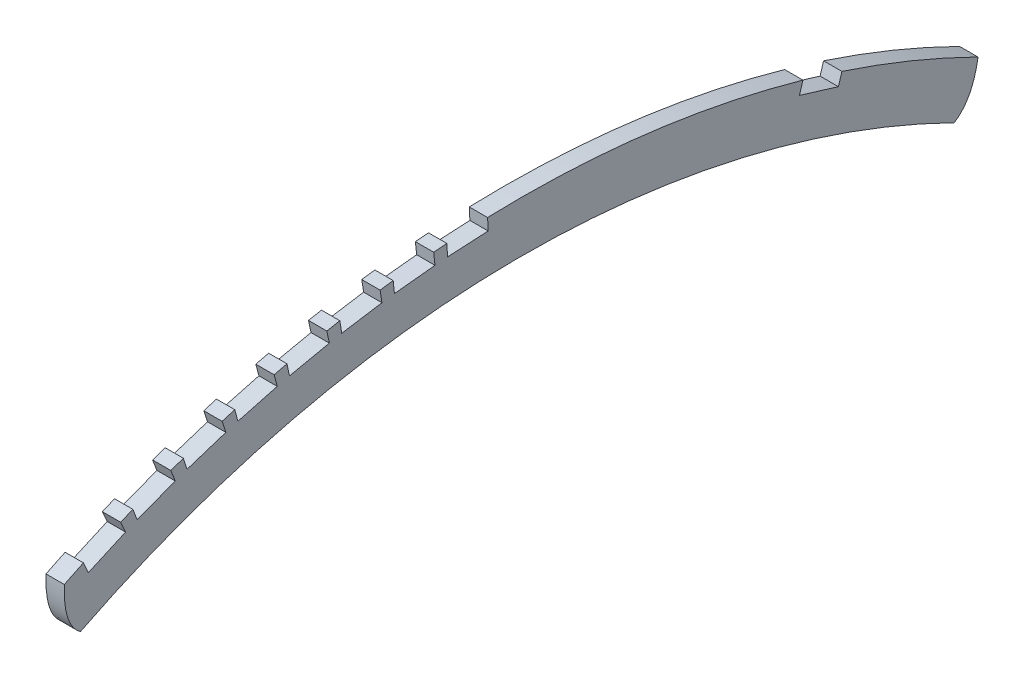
ISO-10303-21;
HEADER;
FILE_DESCRIPTION(('STEP AP214'),'2;1');
FILE_NAME('part.step','',(''),(''),'','','');
FILE_SCHEMA(('AUTOMOTIVE_DESIGN { 1 0 10303 214 1 1 1 1 }'));
ENDSEC;
DATA;
#1=APPLICATION_CONTEXT('core data for automotive mechanical design processes');
#2=APPLICATION_PROTOCOL_DEFINITION('international standard','automotive_design',2000,#1);
#3=PRODUCT_CONTEXT('',#1,'mechanical');
#4=PRODUCT('Part','Part','',(#3));
#5=PRODUCT_RELATED_PRODUCT_CATEGORY('part','',(#4));
#6=PRODUCT_DEFINITION_FORMATION('','',#4);
#7=PRODUCT_DEFINITION_CONTEXT('part definition',#1,'design');
#8=PRODUCT_DEFINITION('design','',#6,#7);
#9=PRODUCT_DEFINITION_SHAPE('','',#8);
#10=(LENGTH_UNIT() NAMED_UNIT(*) SI_UNIT(.MILLI.,.METRE.));
#11=(NAMED_UNIT(*) PLANE_ANGLE_UNIT() SI_UNIT($,.RADIAN.));
#12=(NAMED_UNIT(*) SI_UNIT($,.STERADIAN.) SOLID_ANGLE_UNIT());
#13=UNCERTAINTY_MEASURE_WITH_UNIT(LENGTH_MEASURE(1.E-05),#10,'distance_accuracy_value','');
#14=(GEOMETRIC_REPRESENTATION_CONTEXT(3) GLOBAL_UNCERTAINTY_ASSIGNED_CONTEXT((#13)) GLOBAL_UNIT_ASSIGNED_CONTEXT((#10,
#11,#12)) REPRESENTATION_CONTEXT('',''));
#15=CARTESIAN_POINT('',(0.,0.,0.));
#16=DIRECTION('',(0.,0.,1.));
#17=DIRECTION('',(1.,0.,0.));
#18=AXIS2_PLACEMENT_3D('',#15,#16,#17);
#19=CARTESIAN_POINT('',(18.,907.152568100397,448.573516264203));
#20=CARTESIAN_POINT('',(18.,883.276847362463,449.445951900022));
#21=CARTESIAN_POINT('',(18.,867.289284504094,444.157653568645));
#22=CARTESIAN_POINT('',(18.,859.189879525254,432.708621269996));
#23=B_SPLINE_CURVE_WITH_KNOTS('',3,(#19,#20,#21,#22),.UNSPECIFIED.,.F.,.F.,(4,4),(0.,
0.457409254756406),.UNSPECIFIED.);
#24=DIRECTION('',(-1.,0.,0.));
#25=VECTOR('',#24,1.);
#26=SURFACE_OF_LINEAR_EXTRUSION('',#23,#25);
#27=CARTESIAN_POINT('',(0.,907.152568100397,448.573516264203));
#28=CARTESIAN_POINT('',(0.,883.276847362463,449.445951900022));
#29=CARTESIAN_POINT('',(0.,867.289284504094,444.157653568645));
#30=CARTESIAN_POINT('',(0.,859.189879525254,432.708621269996));
#31=B_SPLINE_CURVE_WITH_KNOTS('',3,(#27,#28,#29,#30),.UNSPECIFIED.,.F.,.F.,(4,4),(0.,
0.457409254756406),.UNSPECIFIED.);
#32=CARTESIAN_POINT('',(0.,907.152568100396,448.573516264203));
#33=VERTEX_POINT('',#32);
#34=CARTESIAN_POINT('',(0.,859.189879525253,432.708621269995));
#35=VERTEX_POINT('',#34);
#36=EDGE_CURVE('E323',#33,#35,#31,.T.);
#37=ORIENTED_EDGE('',*,*,#36,.T.);
#38=DIRECTION('',(-1.,0.,0.));
#39=VECTOR('',#38,1.);
#40=CARTESIAN_POINT('',(18.,859.189879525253,432.708621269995));
#41=LINE('',#40,#39);
#42=CARTESIAN_POINT('',(18.,859.189879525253,432.708621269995));
#43=VERTEX_POINT('',#42);
#44=EDGE_CURVE('E12',#43,#35,#41,.T.);
#45=ORIENTED_EDGE('',*,*,#44,.F.);
#46=CARTESIAN_POINT('',(18.,907.152568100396,448.573516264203));
#47=VERTEX_POINT('',#46);
#48=EDGE_CURVE('E344',#47,#43,#23,.T.);
#49=ORIENTED_EDGE('',*,*,#48,.F.);
#50=DIRECTION('',(-1.,0.,0.));
#51=VECTOR('',#50,1.);
#52=CARTESIAN_POINT('',(18.,907.152568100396,448.573516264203));
#53=LINE('',#52,#51);
#54=EDGE_CURVE('E319',#47,#33,#53,.T.);
#55=ORIENTED_EDGE('',*,*,#54,.T.);
#56=EDGE_LOOP('',(#37,#45,#49,#55));
#57=FACE_BOUND('',#56,.T.);
#58=ADVANCED_FACE('F35',(#57),#26,.F.);
#59=CARTESIAN_POINT('',(18.,0.,0.));
#60=DIRECTION('',(-1.,0.,0.));
#61=DIRECTION('',(0.,0.,1.));
#62=AXIS2_PLACEMENT_3D('',#59,#60,#61);
#63=CYLINDRICAL_SURFACE('',#62,962.);
#64=CARTESIAN_POINT('',(0.,0.,0.));
#65=DIRECTION('',(-1.,0.,0.));
#66=DIRECTION('',(0.,0.,-1.));
#67=AXIS2_PLACEMENT_3D('',#64,#65,#66);
#68=CIRCLE('',#67,962.);
#69=CARTESIAN_POINT('',(0.,862.911633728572,-425.238183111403));
#70=VERTEX_POINT('',#69);
#71=EDGE_CURVE('E329',#35,#70,#68,.T.);
#72=ORIENTED_EDGE('',*,*,#71,.T.);
#73=DIRECTION('',(-1.,0.,0.));
#74=VECTOR('',#73,1.);
#75=CARTESIAN_POINT('',(18.,862.911633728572,-425.238183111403));
#76=LINE('',#75,#74);
#77=CARTESIAN_POINT('',(18.,862.911633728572,-425.238183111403));
#78=VERTEX_POINT('',#77);
#79=EDGE_CURVE('E44',#78,#70,#76,.T.);
#80=ORIENTED_EDGE('',*,*,#79,.F.);
#81=CARTESIAN_POINT('',(18.,0.,0.));
#82=DIRECTION('',(-1.,0.,0.));
#83=DIRECTION('',(0.,0.,-1.));
#84=AXIS2_PLACEMENT_3D('',#81,#82,#83);
#85=CIRCLE('',#84,962.);
#86=EDGE_CURVE('E191',#43,#78,#85,.T.);
#87=ORIENTED_EDGE('',*,*,#86,.F.);
#88=ORIENTED_EDGE('',*,*,#44,.T.);
#89=EDGE_LOOP('',(#72,#80,#87,#88));
#90=FACE_BOUND('',#89,.T.);
#91=ADVANCED_FACE('F758',(#90),#63,.F.);
#92=CARTESIAN_POINT('',(18.,862.911633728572,-425.238183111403));
#93=CARTESIAN_POINT('',(18.,870.69935136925,-437.404278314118));
#94=CARTESIAN_POINT('',(18.,885.44632947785,-445.18272272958));
#95=CARTESIAN_POINT('',(18.,907.152568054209,-448.573516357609));
#96=B_SPLINE_CURVE_WITH_KNOTS('',3,(#92,#93,#94,#95),.UNSPECIFIED.,.F.,.F.,(4,4),
(0.531870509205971,1.),.UNSPECIFIED.);
#97=DIRECTION('',(-1.,0.,0.));
#98=VECTOR('',#97,1.);
#99=SURFACE_OF_LINEAR_EXTRUSION('',#96,#98);
#100=CARTESIAN_POINT('',(0.,862.911633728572,-425.238183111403));
#101=CARTESIAN_POINT('',(0.,870.69935136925,-437.404278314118));
#102=CARTESIAN_POINT('',(0.,885.44632947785,-445.18272272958));
#103=CARTESIAN_POINT('',(0.,907.152568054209,-448.573516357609));
#104=B_SPLINE_CURVE_WITH_KNOTS('',3,(#100,#101,#102,#103),.UNSPECIFIED.,.F.,.F.,(4,4),
(0.531870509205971,1.),.UNSPECIFIED.);
#105=CARTESIAN_POINT('',(0.,907.152568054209,-448.573516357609));
#106=VERTEX_POINT('',#105);
#107=EDGE_CURVE('E457',#70,#106,#104,.T.);
#108=ORIENTED_EDGE('',*,*,#107,.T.);
#109=DIRECTION('',(-1.,0.,0.));
#110=VECTOR('',#109,1.);
#111=CARTESIAN_POINT('',(18.,907.152568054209,-448.573516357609));
#112=LINE('',#111,#110);
#113=CARTESIAN_POINT('',(18.,907.152568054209,-448.573516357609));
#114=VERTEX_POINT('',#113);
#115=EDGE_CURVE('E449',#114,#106,#112,.T.);
#116=ORIENTED_EDGE('',*,*,#115,.F.);
#117=EDGE_CURVE('E458',#78,#114,#96,.T.);
#118=ORIENTED_EDGE('',*,*,#117,.F.);
#119=ORIENTED_EDGE('',*,*,#79,.T.);
#120=EDGE_LOOP('',(#108,#116,#118,#119));
#121=FACE_BOUND('',#120,.T.);
#122=ADVANCED_FACE('F455',(#121),#99,.F.);
#123=CARTESIAN_POINT('',(18.,0.,0.));
#124=DIRECTION('',(-1.,0.,0.));
#125=DIRECTION('',(0.,0.,1.));
#126=AXIS2_PLACEMENT_3D('',#123,#124,#125);
#127=CYLINDRICAL_SURFACE('',#126,1011.99999076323);
#128=CARTESIAN_POINT('',(0.,0.,0.));
#129=DIRECTION('',(1.,0.,0.));
#130=DIRECTION('',(0.,0.,-1.));
#131=AXIS2_PLACEMENT_3D('',#128,#129,#130);
#132=CIRCLE('',#131,1011.99999076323);
#133=CARTESIAN_POINT('',(0.,961.743958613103,-314.948470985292));
#134=VERTEX_POINT('',#133);
#135=EDGE_CURVE('E464',#106,#134,#132,.T.);
#136=ORIENTED_EDGE('',*,*,#135,.T.);
#137=DIRECTION('',(-1.,0.,0.));
#138=VECTOR('',#137,1.);
#139=CARTESIAN_POINT('',(18.,961.743958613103,-314.948470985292));
#140=LINE('',#139,#138);
#141=CARTESIAN_POINT('',(18.,961.743958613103,-314.948470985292));
#142=VERTEX_POINT('',#141);
#143=EDGE_CURVE('E446',#142,#134,#140,.T.);
#144=ORIENTED_EDGE('',*,*,#143,.F.);
#145=CARTESIAN_POINT('',(18.,0.,0.));
#146=DIRECTION('',(1.,0.,0.));
#147=DIRECTION('',(0.,0.,-1.));
#148=AXIS2_PLACEMENT_3D('',#145,#146,#147);
#149=CIRCLE('',#148,1011.99999076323);
#150=EDGE_CURVE('E775',#114,#142,#149,.T.);
#151=ORIENTED_EDGE('',*,*,#150,.F.);
#152=ORIENTED_EDGE('',*,*,#115,.T.);
#153=EDGE_LOOP('',(#136,#144,#151,#152));
#154=FACE_BOUND('',#153,.T.);
#155=ADVANCED_FACE('F765',(#154),#127,.T.);
#156=CARTESIAN_POINT('',(18.,961.743958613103,-314.948470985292));
#157=DIRECTION('',(0.,-0.29237170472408,-0.956304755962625));
#158=DIRECTION('',(0.,0.956304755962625,-0.29237170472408));
#159=AXIS2_PLACEMENT_3D('',#156,#157,#158);
#160=PLANE('',#159);
#161=DIRECTION('',(0.,-0.956304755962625,0.29237170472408));
#162=VECTOR('',#161,1.);
#163=CARTESIAN_POINT('',(0.,961.743958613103,-314.948470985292));
#164=LINE('',#163,#162);
#165=CARTESIAN_POINT('',(0.,950.457321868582,-311.497799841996));
#166=VERTEX_POINT('',#165);
#167=EDGE_CURVE('E468',#134,#166,#164,.T.);
#168=ORIENTED_EDGE('',*,*,#167,.T.);
#169=DIRECTION('',(-1.,0.,0.));
#170=VECTOR('',#169,1.);
#171=CARTESIAN_POINT('',(18.,950.457321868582,-311.497799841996));
#172=LINE('',#171,#170);
#173=CARTESIAN_POINT('',(18.,950.457321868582,-311.497799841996));
#174=VERTEX_POINT('',#173);
#175=EDGE_CURVE('E443',#174,#166,#172,.T.);
#176=ORIENTED_EDGE('',*,*,#175,.F.);
#177=DIRECTION('',(0.,-0.956304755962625,0.29237170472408));
#178=VECTOR('',#177,1.);
#179=CARTESIAN_POINT('',(18.,961.743958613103,-314.948470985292));
#180=LINE('',#179,#178);
#181=EDGE_CURVE('E780',#142,#174,#180,.T.);
#182=ORIENTED_EDGE('',*,*,#181,.F.);
#183=ORIENTED_EDGE('',*,*,#143,.T.);
#184=EDGE_LOOP('',(#168,#176,#182,#183));
#185=FACE_BOUND('',#184,.T.);
#186=ADVANCED_FACE('F795',(#185),#160,.F.);
#187=CARTESIAN_POINT('',(18.,956.304755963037,-292.371704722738));
#188=DIRECTION('',(0.,-0.956304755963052,0.292371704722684));
#189=DIRECTION('',(0.,-0.292371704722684,-0.956304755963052));
#190=AXIS2_PLACEMENT_3D('',#187,#188,#189);
#191=PLANE('',#190);
#192=DIRECTION('',(0.,0.292371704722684,0.956304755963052));
#193=VECTOR('',#192,1.);
#194=CARTESIAN_POINT('',(0.,956.304755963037,-292.371704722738));
#195=LINE('',#194,#193);
#196=CARTESIAN_POINT('',(0.,962.152190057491,-273.245609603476));
#197=VERTEX_POINT('',#196);
#198=EDGE_CURVE('E486',#166,#197,#195,.T.);
#199=ORIENTED_EDGE('',*,*,#198,.T.);
#200=DIRECTION('',(-1.,0.,0.));
#201=VECTOR('',#200,1.);
#202=CARTESIAN_POINT('',(18.,962.152190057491,-273.245609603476));
#203=LINE('',#202,#201);
#204=CARTESIAN_POINT('',(18.,962.152190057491,-273.245609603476));
#205=VERTEX_POINT('',#204);
#206=EDGE_CURVE('E440',#205,#197,#203,.T.);
#207=ORIENTED_EDGE('',*,*,#206,.F.);
#208=DIRECTION('',(0.,0.29237170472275,0.956304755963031));
#209=VECTOR('',#208,1.);
#210=CARTESIAN_POINT('',(18.,950.457321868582,-311.497799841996));
#211=LINE('',#210,#209);
#212=EDGE_CURVE('E782',#174,#205,#211,.T.);
#213=ORIENTED_EDGE('',*,*,#212,.F.);
#214=ORIENTED_EDGE('',*,*,#175,.T.);
#215=EDGE_LOOP('',(#199,#207,#213,#214));
#216=FACE_BOUND('',#215,.T.);
#217=ADVANCED_FACE('F798',(#216),#191,.F.);
#218=CARTESIAN_POINT('',(18.,962.152190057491,-273.245609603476));
#219=DIRECTION('',(0.,0.292371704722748,0.956304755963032));
#220=DIRECTION('',(0.,-0.956304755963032,0.292371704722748));
#221=AXIS2_PLACEMENT_3D('',#218,#219,#220);
#222=PLANE('',#221);
#223=DIRECTION('',(0.,0.956304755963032,-0.292371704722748));
#224=VECTOR('',#223,1.);
#225=CARTESIAN_POINT('',(0.,962.152190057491,-273.245609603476));
#226=LINE('',#225,#224);
#227=CARTESIAN_POINT('',(0.,973.438826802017,-276.696280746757));
#228=VERTEX_POINT('',#227);
#229=EDGE_CURVE('E490',#197,#228,#226,.T.);
#230=ORIENTED_EDGE('',*,*,#229,.T.);
#231=DIRECTION('',(-1.,0.,0.));
#232=VECTOR('',#231,1.);
#233=CARTESIAN_POINT('',(18.,973.438826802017,-276.696280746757));
#234=LINE('',#233,#232);
#235=CARTESIAN_POINT('',(18.,973.438826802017,-276.696280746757));
#236=VERTEX_POINT('',#235);
#237=EDGE_CURVE('E437',#236,#228,#234,.T.);
#238=ORIENTED_EDGE('',*,*,#237,.F.);
#239=DIRECTION('',(0.,0.956304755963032,-0.292371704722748));
#240=VECTOR('',#239,1.);
#241=CARTESIAN_POINT('',(18.,962.152190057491,-273.245609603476));
#242=LINE('',#241,#240);
#243=EDGE_CURVE('E784',#205,#236,#242,.T.);
#244=ORIENTED_EDGE('',*,*,#243,.F.);
#245=ORIENTED_EDGE('',*,*,#206,.T.);
#246=EDGE_LOOP('',(#230,#238,#244,#245));
#247=FACE_BOUND('',#246,.T.);
#248=ADVANCED_FACE('F791',(#247),#222,.F.);
#249=CARTESIAN_POINT('',(18.,0.,0.));
#250=DIRECTION('',(-1.,0.,0.));
#251=DIRECTION('',(0.,0.,1.));
#252=AXIS2_PLACEMENT_3D('',#249,#250,#251);
#253=CYLINDRICAL_SURFACE('',#252,1011.99999076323);
#254=CARTESIAN_POINT('',(0.,0.,0.));
#255=DIRECTION('',(1.,0.,0.));
#256=DIRECTION('',(0.,0.,-1.));
#257=AXIS2_PLACEMENT_3D('',#254,#255,#256);
#258=CIRCLE('',#257,1011.99999076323);
#259=CARTESIAN_POINT('',(0.,1011.46242218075,32.9810524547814));
#260=VERTEX_POINT('',#259);
#261=EDGE_CURVE('E494',#228,#260,#258,.T.);
#262=ORIENTED_EDGE('',*,*,#261,.T.);
#263=DIRECTION('',(-1.,0.,0.));
#264=VECTOR('',#263,1.);
#265=CARTESIAN_POINT('',(18.,1011.46242218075,32.9810524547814));
#266=LINE('',#265,#264);
#267=CARTESIAN_POINT('',(18.,1011.46242218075,32.9810524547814));
#268=VERTEX_POINT('',#267);
#269=EDGE_CURVE('E434',#268,#260,#266,.T.);
#270=ORIENTED_EDGE('',*,*,#269,.F.);
#271=CARTESIAN_POINT('',(18.,0.,0.));
#272=DIRECTION('',(1.,0.,0.));
#273=DIRECTION('',(0.,0.,-1.));
#274=AXIS2_PLACEMENT_3D('',#271,#272,#273);
#275=CIRCLE('',#274,1011.99999076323);
#276=EDGE_CURVE('E786',#236,#268,#275,.T.);
#277=ORIENTED_EDGE('',*,*,#276,.F.);
#278=ORIENTED_EDGE('',*,*,#237,.T.);
#279=EDGE_LOOP('',(#262,#270,#277,#278));
#280=FACE_BOUND('',#279,.T.);
#281=ADVANCED_FACE('F657',(#280),#253,.T.);
#282=CARTESIAN_POINT('',(18.,1011.46242218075,32.9810524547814));
#283=DIRECTION('',(0.,0.0523359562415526,-0.998629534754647));
#284=DIRECTION('',(0.,0.998629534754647,0.0523359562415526));
#285=AXIS2_PLACEMENT_3D('',#282,#283,#284);
#286=PLANE('',#285);
#287=DIRECTION('',(0.,-0.998629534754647,-0.0523359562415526));
#288=VECTOR('',#287,1.);
#289=CARTESIAN_POINT('',(0.,1011.46242218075,32.9810524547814));
#290=LINE('',#289,#288);
#291=CARTESIAN_POINT('',(0.,999.676253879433,32.3633655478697));
#292=VERTEX_POINT('',#291);
#293=EDGE_CURVE('E502',#260,#292,#290,.T.);
#294=ORIENTED_EDGE('',*,*,#293,.T.);
#295=DIRECTION('',(-1.,0.,0.));
#296=VECTOR('',#295,1.);
#297=CARTESIAN_POINT('',(18.,999.676253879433,32.3633655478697));
#298=LINE('',#297,#296);
#299=CARTESIAN_POINT('',(18.,999.676253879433,32.3633655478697));
#300=VERTEX_POINT('',#299);
#301=EDGE_CURVE('E431',#300,#292,#298,.T.);
#302=ORIENTED_EDGE('',*,*,#301,.F.);
#303=DIRECTION('',(0.,-0.998629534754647,-0.0523359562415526));
#304=VECTOR('',#303,1.);
#305=CARTESIAN_POINT('',(18.,1011.46242218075,32.9810524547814));
#306=LINE('',#305,#304);
#307=EDGE_CURVE('E666',#268,#300,#306,.T.);
#308=ORIENTED_EDGE('',*,*,#307,.F.);
#309=ORIENTED_EDGE('',*,*,#269,.T.);
#310=EDGE_LOOP('',(#294,#302,#308,#309));
#311=FACE_BOUND('',#310,.T.);
#312=ADVANCED_FACE('F664',(#311),#286,.F.);
#313=CARTESIAN_POINT('',(18.,998.629534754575,52.3359562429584));
#314=DIRECTION('',(0.,-0.99862953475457,-0.0523359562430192));
#315=DIRECTION('',(0.,0.0523359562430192,-0.99862953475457));
#316=AXIS2_PLACEMENT_3D('',#313,#314,#315);
#317=PLANE('',#316);
#318=DIRECTION('',(0.,-0.0523359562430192,0.99862953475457));
#319=VECTOR('',#318,1.);
#320=CARTESIAN_POINT('',(0.,998.629534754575,52.3359562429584));
#321=LINE('',#320,#319);
#322=CARTESIAN_POINT('',(0.,997.582815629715,72.3085469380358));
#323=VERTEX_POINT('',#322);
#324=EDGE_CURVE('E506',#292,#323,#321,.T.);
#325=ORIENTED_EDGE('',*,*,#324,.T.);
#326=DIRECTION('',(-1.,0.,0.));
#327=VECTOR('',#326,1.);
#328=CARTESIAN_POINT('',(18.,997.582815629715,72.3085469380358));
#329=LINE('',#328,#327);
#330=CARTESIAN_POINT('',(18.,997.582815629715,72.3085469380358));
#331=VERTEX_POINT('',#330);
#332=EDGE_CURVE('E428',#331,#323,#329,.T.);
#333=ORIENTED_EDGE('',*,*,#332,.F.);
#334=DIRECTION('',(0.,-0.0523359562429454,0.998629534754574));
#335=VECTOR('',#334,1.);
#336=CARTESIAN_POINT('',(18.,999.676253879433,32.3633655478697));
#337=LINE('',#336,#335);
#338=EDGE_CURVE('E680',#300,#331,#337,.T.);
#339=ORIENTED_EDGE('',*,*,#338,.F.);
#340=ORIENTED_EDGE('',*,*,#301,.T.);
#341=EDGE_LOOP('',(#325,#333,#339,#340));
#342=FACE_BOUND('',#341,.T.);
#343=ADVANCED_FACE('F671',(#342),#317,.F.);
#344=CARTESIAN_POINT('',(18.,997.582815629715,72.3085469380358));
#345=DIRECTION('',(0.,-0.0523359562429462,0.998629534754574));
#346=DIRECTION('',(0.,-0.998629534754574,-0.0523359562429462));
#347=AXIS2_PLACEMENT_3D('',#344,#345,#346);
#348=PLANE('',#347);
#349=DIRECTION('',(0.,0.998629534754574,0.0523359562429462));
#350=VECTOR('',#349,1.);
#351=CARTESIAN_POINT('',(0.,997.582815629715,72.3085469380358));
#352=LINE('',#351,#350);
#353=CARTESIAN_POINT('',(0.,1009.36898393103,72.9262338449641));
#354=VERTEX_POINT('',#353);
#355=EDGE_CURVE('E510',#323,#354,#352,.T.);
#356=ORIENTED_EDGE('',*,*,#355,.T.);
#357=DIRECTION('',(-1.,0.,0.));
#358=VECTOR('',#357,1.);
#359=CARTESIAN_POINT('',(18.,1009.36898393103,72.9262338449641));
#360=LINE('',#359,#358);
#361=CARTESIAN_POINT('',(18.,1009.36898393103,72.9262338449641));
#362=VERTEX_POINT('',#361);
#363=EDGE_CURVE('E425',#362,#354,#360,.T.);
#364=ORIENTED_EDGE('',*,*,#363,.F.);
#365=DIRECTION('',(0.,0.998629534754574,0.0523359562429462));
#366=VECTOR('',#365,1.);
#367=CARTESIAN_POINT('',(18.,997.582815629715,72.3085469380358));
#368=LINE('',#367,#366);
#369=EDGE_CURVE('E677',#331,#362,#368,.T.);
#370=ORIENTED_EDGE('',*,*,#369,.F.);
#371=ORIENTED_EDGE('',*,*,#332,.T.);
#372=EDGE_LOOP('',(#356,#364,#370,#371));
#373=FACE_BOUND('',#372,.T.);
#374=ADVANCED_FACE('F675',(#373),#348,.F.);
#375=CARTESIAN_POINT('',(18.,0.,0.));
#376=DIRECTION('',(-1.,0.,0.));
#377=DIRECTION('',(0.,0.,1.));
#378=AXIS2_PLACEMENT_3D('',#375,#376,#377);
#379=CYLINDRICAL_SURFACE('',#378,1011.99999076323);
#380=CARTESIAN_POINT('',(0.,0.,0.));
#381=DIRECTION('',(1.,0.,0.));
#382=DIRECTION('',(0.,0.,-1.));
#383=AXIS2_PLACEMENT_3D('',#380,#381,#382);
#384=CIRCLE('',#383,1011.99999076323);
#385=CARTESIAN_POINT('',(0.,1008.35015316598,85.8717061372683));
#386=VERTEX_POINT('',#385);
#387=EDGE_CURVE('E514',#354,#386,#384,.T.);
#388=ORIENTED_EDGE('',*,*,#387,.T.);
#389=DIRECTION('',(-1.,0.,0.));
#390=VECTOR('',#389,1.);
#391=CARTESIAN_POINT('',(18.,1008.35015316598,85.8717061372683));
#392=LINE('',#391,#390);
#393=CARTESIAN_POINT('',(18.,1008.35015316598,85.8717061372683));
#394=VERTEX_POINT('',#393);
#395=EDGE_CURVE('E422',#394,#386,#392,.T.);
#396=ORIENTED_EDGE('',*,*,#395,.F.);
#397=CARTESIAN_POINT('',(18.,0.,0.));
#398=DIRECTION('',(1.,0.,0.));
#399=DIRECTION('',(0.,0.,-1.));
#400=AXIS2_PLACEMENT_3D('',#397,#398,#399);
#401=CIRCLE('',#400,1011.99999076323);
#402=EDGE_CURVE('E679',#362,#394,#401,.T.);
#403=ORIENTED_EDGE('',*,*,#402,.F.);
#404=ORIENTED_EDGE('',*,*,#363,.T.);
#405=EDGE_LOOP('',(#388,#396,#403,#404));
#406=FACE_BOUND('',#405,.T.);
#407=ADVANCED_FACE('F815',(#406),#379,.T.);
#408=CARTESIAN_POINT('',(18.,1008.35015316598,85.8717061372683));
#409=DIRECTION('',(0.,0.104528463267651,-0.994521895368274));
#410=DIRECTION('',(0.,0.994521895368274,0.104528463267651));
#411=AXIS2_PLACEMENT_3D('',#408,#409,#410);
#412=PLANE('',#411);
#413=DIRECTION('',(0.,-0.994521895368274,-0.104528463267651));
#414=VECTOR('',#413,1.);
#415=CARTESIAN_POINT('',(0.,1008.35015316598,85.8717061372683));
#416=LINE('',#415,#414);
#417=CARTESIAN_POINT('',(0.,996.612464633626,84.6380253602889));
#418=VERTEX_POINT('',#417);
#419=EDGE_CURVE('E522',#386,#418,#416,.T.);
#420=ORIENTED_EDGE('',*,*,#419,.T.);
#421=DIRECTION('',(-1.,0.,0.));
#422=VECTOR('',#421,1.);
#423=CARTESIAN_POINT('',(18.,996.612464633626,84.6380253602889));
#424=LINE('',#423,#422);
#425=CARTESIAN_POINT('',(18.,996.612464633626,84.6380253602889));
#426=VERTEX_POINT('',#425);
#427=EDGE_CURVE('E419',#426,#418,#424,.T.);
#428=ORIENTED_EDGE('',*,*,#427,.F.);
#429=DIRECTION('',(0.,-0.994521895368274,-0.104528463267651));
#430=VECTOR('',#429,1.);
#431=CARTESIAN_POINT('',(18.,1008.35015316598,85.8717061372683));
#432=LINE('',#431,#430);
#433=EDGE_CURVE('E682',#394,#426,#432,.T.);
#434=ORIENTED_EDGE('',*,*,#433,.F.);
#435=ORIENTED_EDGE('',*,*,#395,.T.);
#436=EDGE_LOOP('',(#420,#428,#434,#435));
#437=FACE_BOUND('',#436,.T.);
#438=ADVANCED_FACE('F818',(#437),#412,.F.);
#439=CARTESIAN_POINT('',(18.,994.521895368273,104.528463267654));
#440=DIRECTION('',(0.,-0.994521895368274,-0.104528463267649));
#441=DIRECTION('',(0.,0.104528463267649,-0.994521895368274));
#442=AXIS2_PLACEMENT_3D('',#439,#440,#441);
#443=PLANE('',#442);
#444=DIRECTION('',(0.,-0.104528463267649,0.994521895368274));
#445=VECTOR('',#444,1.);
#446=CARTESIAN_POINT('',(0.,994.521895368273,104.528463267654));
#447=LINE('',#446,#445);
#448=CARTESIAN_POINT('',(0.,992.43132610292,124.41890117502));
#449=VERTEX_POINT('',#448);
#450=EDGE_CURVE('E526',#418,#449,#447,.T.);
#451=ORIENTED_EDGE('',*,*,#450,.T.);
#452=DIRECTION('',(-1.,0.,0.));
#453=VECTOR('',#452,1.);
#454=CARTESIAN_POINT('',(18.,992.43132610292,124.41890117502));
#455=LINE('',#454,#453);
#456=CARTESIAN_POINT('',(18.,992.43132610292,124.41890117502));
#457=VERTEX_POINT('',#456);
#458=EDGE_CURVE('E416',#457,#449,#455,.T.);
#459=ORIENTED_EDGE('',*,*,#458,.F.);
#460=DIRECTION('',(0.,-0.104528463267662,0.994521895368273));
#461=VECTOR('',#460,1.);
#462=CARTESIAN_POINT('',(18.,996.612464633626,84.6380253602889));
#463=LINE('',#462,#461);
#464=EDGE_CURVE('E688',#426,#457,#463,.T.);
#465=ORIENTED_EDGE('',*,*,#464,.F.);
#466=ORIENTED_EDGE('',*,*,#427,.T.);
#467=EDGE_LOOP('',(#451,#459,#465,#466));
#468=FACE_BOUND('',#467,.T.);
#469=ADVANCED_FACE('F822',(#468),#443,.F.);
#470=CARTESIAN_POINT('',(18.,992.43132610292,124.41890117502));
#471=DIRECTION('',(0.,-0.104528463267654,0.994521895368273));
#472=DIRECTION('',(0.,-0.994521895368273,-0.104528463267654));
#473=AXIS2_PLACEMENT_3D('',#470,#471,#472);
#474=PLANE('',#473);
#475=DIRECTION('',(0.,0.994521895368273,0.104528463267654));
#476=VECTOR('',#475,1.);
#477=CARTESIAN_POINT('',(0.,992.43132610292,124.41890117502));
#478=LINE('',#477,#476);
#479=CARTESIAN_POINT('',(0.,1004.16901463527,125.652581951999));
#480=VERTEX_POINT('',#479);
#481=EDGE_CURVE('E530',#449,#480,#478,.T.);
#482=ORIENTED_EDGE('',*,*,#481,.T.);
#483=DIRECTION('',(-1.,0.,0.));
#484=VECTOR('',#483,1.);
#485=CARTESIAN_POINT('',(18.,1004.16901463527,125.652581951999));
#486=LINE('',#485,#484);
#487=CARTESIAN_POINT('',(18.,1004.16901463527,125.652581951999));
#488=VERTEX_POINT('',#487);
#489=EDGE_CURVE('E413',#488,#480,#486,.T.);
#490=ORIENTED_EDGE('',*,*,#489,.F.);
#491=DIRECTION('',(0.,0.994521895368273,0.104528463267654));
#492=VECTOR('',#491,1.);
#493=CARTESIAN_POINT('',(18.,992.43132610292,124.41890117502));
#494=LINE('',#493,#492);
#495=EDGE_CURVE('E690',#457,#488,#494,.T.);
#496=ORIENTED_EDGE('',*,*,#495,.F.);
#497=ORIENTED_EDGE('',*,*,#458,.T.);
#498=EDGE_LOOP('',(#482,#490,#496,#497));
#499=FACE_BOUND('',#498,.T.);
#500=ADVANCED_FACE('F826',(#499),#474,.F.);
#501=CARTESIAN_POINT('',(18.,0.,0.));
#502=DIRECTION('',(-1.,0.,0.));
#503=DIRECTION('',(0.,0.,1.));
#504=AXIS2_PLACEMENT_3D('',#501,#502,#503);
#505=CYLINDRICAL_SURFACE('',#504,1011.99999076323);
#506=CARTESIAN_POINT('',(0.,0.,0.));
#507=DIRECTION('',(1.,0.,0.));
#508=DIRECTION('',(0.,0.,-1.));
#509=AXIS2_PLACEMENT_3D('',#506,#507,#508);
#510=CIRCLE('',#509,1011.99999076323);
#511=CARTESIAN_POINT('',(0.,1002.47406647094,138.526991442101));
#512=VERTEX_POINT('',#511);
#513=EDGE_CURVE('E534',#480,#512,#510,.T.);
#514=ORIENTED_EDGE('',*,*,#513,.T.);
#515=DIRECTION('',(-1.,0.,0.));
#516=VECTOR('',#515,1.);
#517=CARTESIAN_POINT('',(18.,1002.47406647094,138.526991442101));
#518=LINE('',#517,#516);
#519=CARTESIAN_POINT('',(18.,1002.47406647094,138.526991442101));
#520=VERTEX_POINT('',#519);
#521=EDGE_CURVE('E410',#520,#512,#518,.T.);
#522=ORIENTED_EDGE('',*,*,#521,.F.);
#523=CARTESIAN_POINT('',(18.,0.,0.));
#524=DIRECTION('',(1.,0.,0.));
#525=DIRECTION('',(0.,0.,-1.));
#526=AXIS2_PLACEMENT_3D('',#523,#524,#525);
#527=CIRCLE('',#526,1011.99999076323);
#528=EDGE_CURVE('E692',#488,#520,#527,.T.);
#529=ORIENTED_EDGE('',*,*,#528,.F.);
#530=ORIENTED_EDGE('',*,*,#489,.T.);
#531=EDGE_LOOP('',(#514,#522,#529,#530));
#532=FACE_BOUND('',#531,.T.);
#533=ADVANCED_FACE('F830',(#532),#505,.T.);
#534=CARTESIAN_POINT('',(18.,1002.47406647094,138.526991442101));
#535=DIRECTION('',(0.,0.156434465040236,-0.987688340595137));
#536=DIRECTION('',(0.,0.987688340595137,0.156434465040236));
#537=AXIS2_PLACEMENT_3D('',#534,#535,#536);
#538=PLANE('',#537);
#539=DIRECTION('',(0.,-0.987688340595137,-0.156434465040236));
#540=VECTOR('',#539,1.);
#541=CARTESIAN_POINT('',(0.,1002.47406647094,138.526991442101));
#542=LINE('',#541,#540);
#543=CARTESIAN_POINT('',(0.,990.817029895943,136.680698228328));
#544=VERTEX_POINT('',#543);
#545=EDGE_CURVE('E542',#512,#544,#542,.T.);
#546=ORIENTED_EDGE('',*,*,#545,.T.);
#547=DIRECTION('',(-1.,0.,0.));
#548=VECTOR('',#547,1.);
#549=CARTESIAN_POINT('',(18.,990.817029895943,136.680698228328));
#550=LINE('',#549,#548);
#551=CARTESIAN_POINT('',(18.,990.817029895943,136.680698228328));
#552=VERTEX_POINT('',#551);
#553=EDGE_CURVE('E407',#552,#544,#550,.T.);
#554=ORIENTED_EDGE('',*,*,#553,.F.);
#555=DIRECTION('',(0.,-0.987688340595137,-0.156434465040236));
#556=VECTOR('',#555,1.);
#557=CARTESIAN_POINT('',(18.,1002.47406647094,138.526991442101));
#558=LINE('',#557,#556);
#559=EDGE_CURVE('E694',#520,#552,#558,.T.);
#560=ORIENTED_EDGE('',*,*,#559,.F.);
#561=ORIENTED_EDGE('',*,*,#521,.T.);
#562=EDGE_LOOP('',(#546,#554,#560,#561));
#563=FACE_BOUND('',#562,.T.);
#564=ADVANCED_FACE('F834',(#563),#538,.F.);
#565=CARTESIAN_POINT('',(18.,987.688340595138,156.434465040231));
#566=DIRECTION('',(0.,-0.987688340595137,-0.156434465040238));
#567=DIRECTION('',(0.,0.156434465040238,-0.987688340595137));
#568=AXIS2_PLACEMENT_3D('',#565,#566,#567);
#569=PLANE('',#568);
#570=DIRECTION('',(0.,-0.156434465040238,0.987688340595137));
#571=VECTOR('',#570,1.);
#572=CARTESIAN_POINT('',(0.,987.688340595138,156.434465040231));
#573=LINE('',#572,#571);
#574=CARTESIAN_POINT('',(0.,984.559651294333,176.188231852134));
#575=VERTEX_POINT('',#574);
#576=EDGE_CURVE('E546',#544,#575,#573,.T.);
#577=ORIENTED_EDGE('',*,*,#576,.T.);
#578=DIRECTION('',(-1.,0.,0.));
#579=VECTOR('',#578,1.);
#580=CARTESIAN_POINT('',(18.,984.559651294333,176.188231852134));
#581=LINE('',#580,#579);
#582=CARTESIAN_POINT('',(18.,984.559651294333,176.188231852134));
#583=VERTEX_POINT('',#582);
#584=EDGE_CURVE('E404',#583,#575,#581,.T.);
#585=ORIENTED_EDGE('',*,*,#584,.F.);
#586=DIRECTION('',(0.,-0.156434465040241,0.987688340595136));
#587=VECTOR('',#586,1.);
#588=CARTESIAN_POINT('',(18.,990.817029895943,136.680698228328));
#589=LINE('',#588,#587);
#590=EDGE_CURVE('E696',#552,#583,#589,.T.);
#591=ORIENTED_EDGE('',*,*,#590,.F.);
#592=ORIENTED_EDGE('',*,*,#553,.T.);
#593=EDGE_LOOP('',(#577,#585,#591,#592));
#594=FACE_BOUND('',#593,.T.);
#595=ADVANCED_FACE('F838',(#594),#569,.F.);
#596=CARTESIAN_POINT('',(18.,984.559651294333,176.188231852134));
#597=DIRECTION('',(0.,-0.156434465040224,0.987688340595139));
#598=DIRECTION('',(0.,-0.987688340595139,-0.156434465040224));
#599=AXIS2_PLACEMENT_3D('',#596,#597,#598);
#600=PLANE('',#599);
#601=DIRECTION('',(0.,0.987688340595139,0.156434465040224));
#602=VECTOR('',#601,1.);
#603=CARTESIAN_POINT('',(0.,984.559651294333,176.188231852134));
#604=LINE('',#603,#602);
#605=CARTESIAN_POINT('',(0.,996.216687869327,178.034525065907));
#606=VERTEX_POINT('',#605);
#607=EDGE_CURVE('E550',#575,#606,#604,.T.);
#608=ORIENTED_EDGE('',*,*,#607,.T.);
#609=DIRECTION('',(-1.,0.,0.));
#610=VECTOR('',#609,1.);
#611=CARTESIAN_POINT('',(18.,996.216687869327,178.034525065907));
#612=LINE('',#611,#610);
#613=CARTESIAN_POINT('',(18.,996.216687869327,178.034525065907));
#614=VERTEX_POINT('',#613);
#615=EDGE_CURVE('E401',#614,#606,#612,.T.);
#616=ORIENTED_EDGE('',*,*,#615,.F.);
#617=DIRECTION('',(0.,0.987688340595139,0.156434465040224));
#618=VECTOR('',#617,1.);
#619=CARTESIAN_POINT('',(18.,984.559651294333,176.188231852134));
#620=LINE('',#619,#618);
#621=EDGE_CURVE('E698',#583,#614,#620,.T.);
#622=ORIENTED_EDGE('',*,*,#621,.F.);
#623=ORIENTED_EDGE('',*,*,#584,.T.);
#624=EDGE_LOOP('',(#608,#616,#622,#623));
#625=FACE_BOUND('',#624,.T.);
#626=ADVANCED_FACE('F842',(#625),#600,.F.);
#627=CARTESIAN_POINT('',(18.,0.,0.));
#628=DIRECTION('',(-1.,0.,0.));
#629=DIRECTION('',(0.,0.,1.));
#630=AXIS2_PLACEMENT_3D('',#627,#628,#629);
#631=CYLINDRICAL_SURFACE('',#630,1011.99999076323);
#632=CARTESIAN_POINT('',(0.,0.,0.));
#633=DIRECTION('',(1.,0.,0.));
#634=DIRECTION('',(0.,0.,-1.));
#635=AXIS2_PLACEMENT_3D('',#632,#633,#634);
#636=CIRCLE('',#635,1011.99999076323);
#637=CARTESIAN_POINT('',(0.,993.850268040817,190.802583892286));
#638=VERTEX_POINT('',#637);
#639=EDGE_CURVE('E554',#606,#638,#636,.T.);
#640=ORIENTED_EDGE('',*,*,#639,.T.);
#641=DIRECTION('',(-1.,0.,0.));
#642=VECTOR('',#641,1.);
#643=CARTESIAN_POINT('',(18.,993.850268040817,190.802583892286));
#644=LINE('',#643,#642);
#645=CARTESIAN_POINT('',(18.,993.850268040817,190.802583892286));
#646=VERTEX_POINT('',#645);
#647=EDGE_CURVE('E398',#646,#638,#644,.T.);
#648=ORIENTED_EDGE('',*,*,#647,.F.);
#649=CARTESIAN_POINT('',(18.,0.,0.));
#650=DIRECTION('',(1.,0.,0.));
#651=DIRECTION('',(0.,0.,-1.));
#652=AXIS2_PLACEMENT_3D('',#649,#650,#651);
#653=CIRCLE('',#652,1011.99999076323);
#654=EDGE_CURVE('E700',#614,#646,#653,.T.);
#655=ORIENTED_EDGE('',*,*,#654,.F.);
#656=ORIENTED_EDGE('',*,*,#615,.T.);
#657=EDGE_LOOP('',(#640,#648,#655,#656));
#658=FACE_BOUND('',#657,.T.);
#659=ADVANCED_FACE('F846',(#658),#631,.T.);
#660=CARTESIAN_POINT('',(18.,993.850268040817,190.802583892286));
#661=DIRECTION('',(0.,0.207911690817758,-0.978147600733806));
#662=DIRECTION('',(0.,0.978147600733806,0.207911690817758));
#663=AXIS2_PLACEMENT_3D('',#660,#661,#662);
#664=PLANE('',#663);
#665=DIRECTION('',(0.,-0.978147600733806,-0.207911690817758));
#666=VECTOR('',#665,1.);
#667=CARTESIAN_POINT('',(0.,993.850268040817,190.802583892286));
#668=LINE('',#667,#666);
#669=CARTESIAN_POINT('',(0.,982.305834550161,188.348738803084));
#670=VERTEX_POINT('',#669);
#671=EDGE_CURVE('E562',#638,#670,#668,.T.);
#672=ORIENTED_EDGE('',*,*,#671,.T.);
#673=DIRECTION('',(-1.,0.,0.));
#674=VECTOR('',#673,1.);
#675=CARTESIAN_POINT('',(18.,982.305834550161,188.348738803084));
#676=LINE('',#675,#674);
#677=CARTESIAN_POINT('',(18.,982.305834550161,188.348738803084));
#678=VERTEX_POINT('',#677);
#679=EDGE_CURVE('E395',#678,#670,#676,.T.);
#680=ORIENTED_EDGE('',*,*,#679,.F.);
#681=DIRECTION('',(0.,-0.978147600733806,-0.207911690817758));
#682=VECTOR('',#681,1.);
#683=CARTESIAN_POINT('',(18.,993.850268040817,190.802583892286));
#684=LINE('',#683,#682);
#685=EDGE_CURVE('E702',#646,#678,#684,.T.);
#686=ORIENTED_EDGE('',*,*,#685,.F.);
#687=ORIENTED_EDGE('',*,*,#647,.T.);
#688=EDGE_LOOP('',(#672,#680,#686,#687));
#689=FACE_BOUND('',#688,.T.);
#690=ADVANCED_FACE('F850',(#689),#664,.F.);
#691=CARTESIAN_POINT('',(18.,978.147600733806,207.91169081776));
#692=DIRECTION('',(0.,-0.978147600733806,-0.207911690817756));
#693=DIRECTION('',(0.,0.207911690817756,-0.978147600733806));
#694=AXIS2_PLACEMENT_3D('',#691,#692,#693);
#695=PLANE('',#694);
#696=DIRECTION('',(0.,-0.207911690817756,0.978147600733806));
#697=VECTOR('',#696,1.);
#698=CARTESIAN_POINT('',(0.,978.147600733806,207.91169081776));
#699=LINE('',#698,#697);
#700=CARTESIAN_POINT('',(0.,973.98936691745,227.474642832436));
#701=VERTEX_POINT('',#700);
#702=EDGE_CURVE('E566',#670,#701,#699,.T.);
#703=ORIENTED_EDGE('',*,*,#702,.T.);
#704=DIRECTION('',(-1.,0.,0.));
#705=VECTOR('',#704,1.);
#706=CARTESIAN_POINT('',(18.,973.98936691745,227.474642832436));
#707=LINE('',#706,#705);
#708=CARTESIAN_POINT('',(18.,973.98936691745,227.474642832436));
#709=VERTEX_POINT('',#708);
#710=EDGE_CURVE('E392',#709,#701,#707,.T.);
#711=ORIENTED_EDGE('',*,*,#710,.F.);
#712=DIRECTION('',(0.,-0.207911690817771,0.978147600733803));
#713=VECTOR('',#712,1.);
#714=CARTESIAN_POINT('',(18.,982.305834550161,188.348738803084));
#715=LINE('',#714,#713);
#716=EDGE_CURVE('E704',#678,#709,#715,.T.);
#717=ORIENTED_EDGE('',*,*,#716,.F.);
#718=ORIENTED_EDGE('',*,*,#679,.T.);
#719=EDGE_LOOP('',(#703,#711,#717,#718));
#720=FACE_BOUND('',#719,.T.);
#721=ADVANCED_FACE('F854',(#720),#695,.F.);
#722=CARTESIAN_POINT('',(18.,973.98936691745,227.474642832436));
#723=DIRECTION('',(0.,-0.207911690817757,0.978147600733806));
#724=DIRECTION('',(0.,-0.978147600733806,-0.207911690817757));
#725=AXIS2_PLACEMENT_3D('',#722,#723,#724);
#726=PLANE('',#725);
#727=DIRECTION('',(0.,0.978147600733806,0.207911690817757));
#728=VECTOR('',#727,1.);
#729=CARTESIAN_POINT('',(0.,973.98936691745,227.474642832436));
#730=LINE('',#729,#728);
#731=CARTESIAN_POINT('',(0.,985.533800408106,229.928487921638));
#732=VERTEX_POINT('',#731);
#733=EDGE_CURVE('E570',#701,#732,#730,.T.);
#734=ORIENTED_EDGE('',*,*,#733,.T.);
#735=DIRECTION('',(-1.,0.,0.));
#736=VECTOR('',#735,1.);
#737=CARTESIAN_POINT('',(18.,985.533800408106,229.928487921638));
#738=LINE('',#737,#736);
#739=CARTESIAN_POINT('',(18.,985.533800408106,229.928487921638));
#740=VERTEX_POINT('',#739);
#741=EDGE_CURVE('E389',#740,#732,#738,.T.);
#742=ORIENTED_EDGE('',*,*,#741,.F.);
#743=DIRECTION('',(0.,0.978147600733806,0.207911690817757));
#744=VECTOR('',#743,1.);
#745=CARTESIAN_POINT('',(18.,973.98936691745,227.474642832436));
#746=LINE('',#745,#744);
#747=EDGE_CURVE('E706',#709,#740,#746,.T.);
#748=ORIENTED_EDGE('',*,*,#747,.F.);
#749=ORIENTED_EDGE('',*,*,#710,.T.);
#750=EDGE_LOOP('',(#734,#742,#748,#749));
#751=FACE_BOUND('',#750,.T.);
#752=ADVANCED_FACE('F858',(#751),#726,.F.);
#753=CARTESIAN_POINT('',(18.,0.,0.));
#754=DIRECTION('',(-1.,0.,0.));
#755=DIRECTION('',(0.,0.,1.));
#756=AXIS2_PLACEMENT_3D('',#753,#754,#755);
#757=CYLINDRICAL_SURFACE('',#756,1011.99999076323);
#758=CARTESIAN_POINT('',(0.,0.,0.));
#759=DIRECTION('',(1.,0.,0.));
#760=DIRECTION('',(0.,0.,-1.));
#761=AXIS2_PLACEMENT_3D('',#758,#759,#760);
#762=CIRCLE('',#761,1011.99999076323);
#763=CARTESIAN_POINT('',(0.,982.502395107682,242.555199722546));
#764=VERTEX_POINT('',#763);
#765=EDGE_CURVE('E574',#732,#764,#762,.T.);
#766=ORIENTED_EDGE('',*,*,#765,.T.);
#767=DIRECTION('',(-1.,0.,0.));
#768=VECTOR('',#767,1.);
#769=CARTESIAN_POINT('',(18.,982.502395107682,242.555199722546));
#770=LINE('',#769,#768);
#771=CARTESIAN_POINT('',(18.,982.502395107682,242.555199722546));
#772=VERTEX_POINT('',#771);
#773=EDGE_CURVE('E386',#772,#764,#770,.T.);
#774=ORIENTED_EDGE('',*,*,#773,.F.);
#775=CARTESIAN_POINT('',(18.,0.,0.));
#776=DIRECTION('',(1.,0.,0.));
#777=DIRECTION('',(0.,0.,-1.));
#778=AXIS2_PLACEMENT_3D('',#775,#776,#777);
#779=CIRCLE('',#778,1011.99999076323);
#780=EDGE_CURVE('E708',#740,#772,#779,.T.);
#781=ORIENTED_EDGE('',*,*,#780,.F.);
#782=ORIENTED_EDGE('',*,*,#741,.T.);
#783=EDGE_LOOP('',(#766,#774,#781,#782));
#784=FACE_BOUND('',#783,.T.);
#785=ADVANCED_FACE('F862',(#784),#757,.T.);
#786=CARTESIAN_POINT('',(18.,982.502395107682,242.555199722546));
#787=DIRECTION('',(0.,0.258819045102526,-0.965925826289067));
#788=DIRECTION('',(0.,0.965925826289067,0.258819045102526));
#789=AXIS2_PLACEMENT_3D('',#786,#787,#788);
#790=PLANE('',#789);
#791=DIRECTION('',(0.,-0.965925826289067,-0.258819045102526));
#792=VECTOR('',#791,1.);
#793=CARTESIAN_POINT('',(0.,982.502395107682,242.555199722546));
#794=LINE('',#793,#792);
#795=CARTESIAN_POINT('',(0.,971.102207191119,239.50052857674));
#796=VERTEX_POINT('',#795);
#797=EDGE_CURVE('E582',#764,#796,#794,.T.);
#798=ORIENTED_EDGE('',*,*,#797,.T.);
#799=DIRECTION('',(-1.,0.,0.));
#800=VECTOR('',#799,1.);
#801=CARTESIAN_POINT('',(18.,971.102207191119,239.50052857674));
#802=LINE('',#801,#800);
#803=CARTESIAN_POINT('',(18.,971.102207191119,239.50052857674));
#804=VERTEX_POINT('',#803);
#805=EDGE_CURVE('E383',#804,#796,#802,.T.);
#806=ORIENTED_EDGE('',*,*,#805,.F.);
#807=DIRECTION('',(0.,-0.965925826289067,-0.258819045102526));
#808=VECTOR('',#807,1.);
#809=CARTESIAN_POINT('',(18.,982.502395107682,242.555199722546));
#810=LINE('',#809,#808);
#811=EDGE_CURVE('E710',#772,#804,#810,.T.);
#812=ORIENTED_EDGE('',*,*,#811,.F.);
#813=ORIENTED_EDGE('',*,*,#773,.T.);
#814=EDGE_LOOP('',(#798,#806,#812,#813));
#815=FACE_BOUND('',#814,.T.);
#816=ADVANCED_FACE('F866',(#815),#790,.F.);
#817=CARTESIAN_POINT('',(18.,965.925826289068,258.819045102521));
#818=DIRECTION('',(0.,-0.965925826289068,-0.258819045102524));
#819=DIRECTION('',(0.,0.258819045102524,-0.965925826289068));
#820=AXIS2_PLACEMENT_3D('',#817,#818,#819);
#821=PLANE('',#820);
#822=DIRECTION('',(0.,-0.258819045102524,0.965925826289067));
#823=VECTOR('',#822,1.);
#824=CARTESIAN_POINT('',(0.,965.925826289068,258.819045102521));
#825=LINE('',#824,#823);
#826=CARTESIAN_POINT('',(0.,960.749445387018,278.137561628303));
#827=VERTEX_POINT('',#826);
#828=EDGE_CURVE('E586',#796,#827,#825,.T.);
#829=ORIENTED_EDGE('',*,*,#828,.T.);
#830=DIRECTION('',(-1.,0.,0.));
#831=VECTOR('',#830,1.);
#832=CARTESIAN_POINT('',(18.,960.749445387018,278.137561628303));
#833=LINE('',#832,#831);
#834=CARTESIAN_POINT('',(18.,960.749445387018,278.137561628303));
#835=VERTEX_POINT('',#834);
#836=EDGE_CURVE('E380',#835,#827,#833,.T.);
#837=ORIENTED_EDGE('',*,*,#836,.F.);
#838=DIRECTION('',(0.,-0.258819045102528,0.965925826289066));
#839=VECTOR('',#838,1.);
#840=CARTESIAN_POINT('',(18.,971.102207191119,239.50052857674));
#841=LINE('',#840,#839);
#842=EDGE_CURVE('E712',#804,#835,#841,.T.);
#843=ORIENTED_EDGE('',*,*,#842,.F.);
#844=ORIENTED_EDGE('',*,*,#805,.T.);
#845=EDGE_LOOP('',(#829,#837,#843,#844));
#846=FACE_BOUND('',#845,.T.);
#847=ADVANCED_FACE('F870',(#846),#821,.F.);
#848=CARTESIAN_POINT('',(18.,960.749445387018,278.137561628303));
#849=DIRECTION('',(0.,-0.258819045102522,0.965925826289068));
#850=DIRECTION('',(0.,-0.965925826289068,-0.258819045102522));
#851=AXIS2_PLACEMENT_3D('',#848,#849,#850);
#852=PLANE('',#851);
#853=DIRECTION('',(0.,0.965925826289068,0.258819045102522));
#854=VECTOR('',#853,1.);
#855=CARTESIAN_POINT('',(0.,960.749445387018,278.137561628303));
#856=LINE('',#855,#854);
#857=CARTESIAN_POINT('',(0.,972.149633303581,281.192232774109));
#858=VERTEX_POINT('',#857);
#859=EDGE_CURVE('E590',#827,#858,#856,.T.);
#860=ORIENTED_EDGE('',*,*,#859,.T.);
#861=DIRECTION('',(-1.,0.,0.));
#862=VECTOR('',#861,1.);
#863=CARTESIAN_POINT('',(18.,972.149633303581,281.192232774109));
#864=LINE('',#863,#862);
#865=CARTESIAN_POINT('',(18.,972.149633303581,281.192232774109));
#866=VERTEX_POINT('',#865);
#867=EDGE_CURVE('E377',#866,#858,#864,.T.);
#868=ORIENTED_EDGE('',*,*,#867,.F.);
#869=DIRECTION('',(0.,0.965925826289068,0.258819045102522));
#870=VECTOR('',#869,1.);
#871=CARTESIAN_POINT('',(18.,960.749445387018,278.137561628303));
#872=LINE('',#871,#870);
#873=EDGE_CURVE('E714',#835,#866,#872,.T.);
#874=ORIENTED_EDGE('',*,*,#873,.F.);
#875=ORIENTED_EDGE('',*,*,#836,.T.);
#876=EDGE_LOOP('',(#860,#868,#874,#875));
#877=FACE_BOUND('',#876,.T.);
#878=ADVANCED_FACE('F874',(#877),#852,.F.);
#879=CARTESIAN_POINT('',(18.,0.,0.));
#880=DIRECTION('',(-1.,0.,0.));
#881=DIRECTION('',(0.,0.,1.));
#882=AXIS2_PLACEMENT_3D('',#879,#880,#881);
#883=CYLINDRICAL_SURFACE('',#882,1011.99999076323);
#884=CARTESIAN_POINT('',(0.,0.,0.));
#885=DIRECTION('',(1.,0.,0.));
#886=DIRECTION('',(0.,0.,-1.));
#887=AXIS2_PLACEMENT_3D('',#884,#885,#886);
#888=CIRCLE('',#887,1011.99999076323);
#889=CARTESIAN_POINT('',(0.,968.461551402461,293.642988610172));
#890=VERTEX_POINT('',#889);
#891=EDGE_CURVE('E594',#858,#890,#888,.T.);
#892=ORIENTED_EDGE('',*,*,#891,.T.);
#893=DIRECTION('',(-1.,0.,0.));
#894=VECTOR('',#893,1.);
#895=CARTESIAN_POINT('',(18.,968.461551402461,293.642988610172));
#896=LINE('',#895,#894);
#897=CARTESIAN_POINT('',(18.,968.461551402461,293.642988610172));
#898=VERTEX_POINT('',#897);
#899=EDGE_CURVE('E374',#898,#890,#896,.T.);
#900=ORIENTED_EDGE('',*,*,#899,.F.);
#901=CARTESIAN_POINT('',(18.,0.,0.));
#902=DIRECTION('',(1.,0.,0.));
#903=DIRECTION('',(0.,0.,-1.));
#904=AXIS2_PLACEMENT_3D('',#901,#902,#903);
#905=CIRCLE('',#904,1011.99999076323);
#906=EDGE_CURVE('E716',#866,#898,#905,.T.);
#907=ORIENTED_EDGE('',*,*,#906,.F.);
#908=ORIENTED_EDGE('',*,*,#867,.T.);
#909=EDGE_LOOP('',(#892,#900,#907,#908));
#910=FACE_BOUND('',#909,.T.);
#911=ADVANCED_FACE('F878',(#910),#883,.T.);
#912=CARTESIAN_POINT('',(18.,968.461551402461,293.642988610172));
#913=DIRECTION('',(0.,0.309016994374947,-0.951056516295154));
#914=DIRECTION('',(0.,0.951056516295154,0.309016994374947));
#915=AXIS2_PLACEMENT_3D('',#912,#913,#914);
#916=PLANE('',#915);
#917=DIRECTION('',(0.,-0.951056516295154,-0.309016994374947));
#918=VECTOR('',#917,1.);
#919=CARTESIAN_POINT('',(0.,968.461551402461,293.642988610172));
#920=LINE('',#919,#918);
#921=CARTESIAN_POINT('',(0.,957.236856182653,289.995864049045));
#922=VERTEX_POINT('',#921);
#923=EDGE_CURVE('E602',#890,#922,#920,.T.);
#924=ORIENTED_EDGE('',*,*,#923,.T.);
#925=DIRECTION('',(-1.,0.,0.));
#926=VECTOR('',#925,1.);
#927=CARTESIAN_POINT('',(18.,957.236856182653,289.995864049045));
#928=LINE('',#927,#926);
#929=CARTESIAN_POINT('',(18.,957.236856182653,289.995864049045));
#930=VERTEX_POINT('',#929);
#931=EDGE_CURVE('E371',#930,#922,#928,.T.);
#932=ORIENTED_EDGE('',*,*,#931,.F.);
#933=DIRECTION('',(0.,-0.951056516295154,-0.309016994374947));
#934=VECTOR('',#933,1.);
#935=CARTESIAN_POINT('',(18.,968.461551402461,293.642988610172));
#936=LINE('',#935,#934);
#937=EDGE_CURVE('E718',#898,#930,#936,.T.);
#938=ORIENTED_EDGE('',*,*,#937,.F.);
#939=ORIENTED_EDGE('',*,*,#899,.T.);
#940=EDGE_LOOP('',(#924,#932,#938,#939));
#941=FACE_BOUND('',#940,.T.);
#942=ADVANCED_FACE('F882',(#941),#916,.F.);
#943=CARTESIAN_POINT('',(18.,951.056516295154,309.016994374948));
#944=DIRECTION('',(0.,-0.951056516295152,-0.309016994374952));
#945=DIRECTION('',(0.,0.309016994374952,-0.951056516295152));
#946=AXIS2_PLACEMENT_3D('',#943,#944,#945);
#947=PLANE('',#946);
#948=DIRECTION('',(0.,-0.309016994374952,0.951056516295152));
#949=VECTOR('',#948,1.);
#950=CARTESIAN_POINT('',(0.,951.056516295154,309.016994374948));
#951=LINE('',#950,#949);
#952=CARTESIAN_POINT('',(0.,944.876176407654,328.038124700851));
#953=VERTEX_POINT('',#952);
#954=EDGE_CURVE('E606',#922,#953,#951,.T.);
#955=ORIENTED_EDGE('',*,*,#954,.T.);
#956=DIRECTION('',(-1.,0.,0.));
#957=VECTOR('',#956,1.);
#958=CARTESIAN_POINT('',(18.,944.876176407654,328.038124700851));
#959=LINE('',#958,#957);
#960=CARTESIAN_POINT('',(18.,944.876176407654,328.038124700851));
#961=VERTEX_POINT('',#960);
#962=EDGE_CURVE('E368',#961,#953,#959,.T.);
#963=ORIENTED_EDGE('',*,*,#962,.F.);
#964=DIRECTION('',(0.,-0.309016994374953,0.951056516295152));
#965=VECTOR('',#964,1.);
#966=CARTESIAN_POINT('',(18.,957.236856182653,289.995864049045));
#967=LINE('',#966,#965);
#968=EDGE_CURVE('E720',#930,#961,#967,.T.);
#969=ORIENTED_EDGE('',*,*,#968,.F.);
#970=ORIENTED_EDGE('',*,*,#931,.T.);
#971=EDGE_LOOP('',(#955,#963,#969,#970));
#972=FACE_BOUND('',#971,.T.);
#973=ADVANCED_FACE('F886',(#972),#947,.F.);
#974=CARTESIAN_POINT('',(18.,944.876176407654,328.038124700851));
#975=DIRECTION('',(0.,-0.309016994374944,0.951056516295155));
#976=DIRECTION('',(0.,-0.951056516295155,-0.309016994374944));
#977=AXIS2_PLACEMENT_3D('',#974,#975,#976);
#978=PLANE('',#977);
#979=DIRECTION('',(0.,0.951056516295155,0.309016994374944));
#980=VECTOR('',#979,1.);
#981=CARTESIAN_POINT('',(0.,944.876176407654,328.038124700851));
#982=LINE('',#981,#980);
#983=CARTESIAN_POINT('',(0.,956.100871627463,331.685249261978));
#984=VERTEX_POINT('',#983);
#985=EDGE_CURVE('E610',#953,#984,#982,.T.);
#986=ORIENTED_EDGE('',*,*,#985,.T.);
#987=DIRECTION('',(-1.,0.,0.));
#988=VECTOR('',#987,1.);
#989=CARTESIAN_POINT('',(18.,956.100871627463,331.685249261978));
#990=LINE('',#989,#988);
#991=CARTESIAN_POINT('',(18.,956.100871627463,331.685249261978));
#992=VERTEX_POINT('',#991);
#993=EDGE_CURVE('E365',#992,#984,#990,.T.);
#994=ORIENTED_EDGE('',*,*,#993,.F.);
#995=DIRECTION('',(0.,0.951056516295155,0.309016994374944));
#996=VECTOR('',#995,1.);
#997=CARTESIAN_POINT('',(18.,944.876176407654,328.038124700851));
#998=LINE('',#997,#996);
#999=EDGE_CURVE('E722',#961,#992,#998,.T.);
#1000=ORIENTED_EDGE('',*,*,#999,.F.);
#1001=ORIENTED_EDGE('',*,*,#962,.T.);
#1002=EDGE_LOOP('',(#986,#994,#1000,#1001));
#1003=FACE_BOUND('',#1002,.T.);
#1004=ADVANCED_FACE('F890',(#1003),#978,.F.);
#1005=CARTESIAN_POINT('',(18.,0.,0.));
#1006=DIRECTION('',(-1.,0.,0.));
#1007=DIRECTION('',(0.,0.,1.));
#1008=AXIS2_PLACEMENT_3D('',#1005,#1006,#1007);
#1009=CYLINDRICAL_SURFACE('',#1008,1011.99999076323);
#1010=CARTESIAN_POINT('',(0.,0.,0.));
#1011=DIRECTION('',(1.,0.,0.));
#1012=DIRECTION('',(0.,0.,-1.));
#1013=AXIS2_PLACEMENT_3D('',#1010,#1011,#1012);
#1014=CIRCLE('',#1013,1011.99999076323);
#1015=CARTESIAN_POINT('',(0.,951.766221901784,343.925922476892));
#1016=VERTEX_POINT('',#1015);
#1017=EDGE_CURVE('E614',#984,#1016,#1014,.T.);
#1018=ORIENTED_EDGE('',*,*,#1017,.T.);
#1019=DIRECTION('',(-1.,0.,0.));
#1020=VECTOR('',#1019,1.);
#1021=CARTESIAN_POINT('',(18.,951.766221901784,343.925922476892));
#1022=LINE('',#1021,#1020);
#1023=CARTESIAN_POINT('',(18.,951.766221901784,343.925922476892));
#1024=VERTEX_POINT('',#1023);
#1025=EDGE_CURVE('E362',#1024,#1016,#1022,.T.);
#1026=ORIENTED_EDGE('',*,*,#1025,.F.);
#1027=CARTESIAN_POINT('',(18.,0.,0.));
#1028=DIRECTION('',(1.,0.,0.));
#1029=DIRECTION('',(0.,0.,-1.));
#1030=AXIS2_PLACEMENT_3D('',#1027,#1028,#1029);
#1031=CIRCLE('',#1030,1011.99999076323);
#1032=EDGE_CURVE('E724',#992,#1024,#1031,.T.);
#1033=ORIENTED_EDGE('',*,*,#1032,.F.);
#1034=ORIENTED_EDGE('',*,*,#993,.T.);
#1035=EDGE_LOOP('',(#1018,#1026,#1033,#1034));
#1036=FACE_BOUND('',#1035,.T.);
#1037=ADVANCED_FACE('F894',(#1036),#1009,.T.);
#1038=CARTESIAN_POINT('',(18.,951.766221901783,343.925922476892));
#1039=DIRECTION('',(0.,0.358367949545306,-0.9335804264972));
#1040=DIRECTION('',(0.,0.9335804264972,0.358367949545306));
#1041=AXIS2_PLACEMENT_3D('',#1038,#1039,#1040);
#1042=PLANE('',#1041);
#1043=DIRECTION('',(0.,-0.9335804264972,-0.358367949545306));
#1044=VECTOR('',#1043,1.);
#1045=CARTESIAN_POINT('',(0.,951.766221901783,343.925922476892));
#1046=LINE('',#1045,#1044);
#1047=CARTESIAN_POINT('',(0.,940.747785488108,339.696341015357));
#1048=VERTEX_POINT('',#1047);
#1049=EDGE_CURVE('E622',#1016,#1048,#1046,.T.);
#1050=ORIENTED_EDGE('',*,*,#1049,.T.);
#1051=DIRECTION('',(-1.,0.,0.));
#1052=VECTOR('',#1051,1.);
#1053=CARTESIAN_POINT('',(18.,940.747785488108,339.696341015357));
#1054=LINE('',#1053,#1052);
#1055=CARTESIAN_POINT('',(18.,940.747785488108,339.696341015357));
#1056=VERTEX_POINT('',#1055);
#1057=EDGE_CURVE('E359',#1056,#1048,#1054,.T.);
#1058=ORIENTED_EDGE('',*,*,#1057,.F.);
#1059=DIRECTION('',(0.,-0.9335804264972,-0.358367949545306));
#1060=VECTOR('',#1059,1.);
#1061=CARTESIAN_POINT('',(18.,951.766221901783,343.925922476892));
#1062=LINE('',#1061,#1060);
#1063=EDGE_CURVE('E726',#1024,#1056,#1062,.T.);
#1064=ORIENTED_EDGE('',*,*,#1063,.F.);
#1065=ORIENTED_EDGE('',*,*,#1025,.T.);
#1066=EDGE_LOOP('',(#1050,#1058,#1064,#1065));
#1067=FACE_BOUND('',#1066,.T.);
#1068=ADVANCED_FACE('F898',(#1067),#1042,.F.);
#1069=CARTESIAN_POINT('',(18.,933.580426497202,358.367949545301));
#1070=DIRECTION('',(0.,-0.933580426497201,-0.358367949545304));
#1071=DIRECTION('',(0.,0.358367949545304,-0.933580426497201));
#1072=AXIS2_PLACEMENT_3D('',#1069,#1070,#1071);
#1073=PLANE('',#1072);
#1074=DIRECTION('',(0.,-0.358367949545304,0.9335804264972));
#1075=VECTOR('',#1074,1.);
#1076=CARTESIAN_POINT('',(0.,933.580426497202,358.367949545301));
#1077=LINE('',#1076,#1075);
#1078=CARTESIAN_POINT('',(0.,926.413067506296,377.039558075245));
#1079=VERTEX_POINT('',#1078);
#1080=EDGE_CURVE('E626',#1048,#1079,#1077,.T.);
#1081=ORIENTED_EDGE('',*,*,#1080,.T.);
#1082=DIRECTION('',(-1.,0.,0.));
#1083=VECTOR('',#1082,1.);
#1084=CARTESIAN_POINT('',(18.,926.413067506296,377.039558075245));
#1085=LINE('',#1084,#1083);
#1086=CARTESIAN_POINT('',(18.,926.413067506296,377.039558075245));
#1087=VERTEX_POINT('',#1086);
#1088=EDGE_CURVE('E356',#1087,#1079,#1085,.T.);
#1089=ORIENTED_EDGE('',*,*,#1088,.F.);
#1090=DIRECTION('',(0.,-0.3583679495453,0.933580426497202));
#1091=VECTOR('',#1090,1.);
#1092=CARTESIAN_POINT('',(18.,940.747785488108,339.696341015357));
#1093=LINE('',#1092,#1091);
#1094=EDGE_CURVE('E728',#1056,#1087,#1093,.T.);
#1095=ORIENTED_EDGE('',*,*,#1094,.F.);
#1096=ORIENTED_EDGE('',*,*,#1057,.T.);
#1097=EDGE_LOOP('',(#1081,#1089,#1095,#1096));
#1098=FACE_BOUND('',#1097,.T.);
#1099=ADVANCED_FACE('F902',(#1098),#1073,.F.);
#1100=CARTESIAN_POINT('',(18.,926.413067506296,377.039558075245));
#1101=DIRECTION('',(0.,-0.358367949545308,0.933580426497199));
#1102=DIRECTION('',(0.,-0.933580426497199,-0.358367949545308));
#1103=AXIS2_PLACEMENT_3D('',#1100,#1101,#1102);
#1104=PLANE('',#1103);
#1105=DIRECTION('',(0.,0.933580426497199,0.358367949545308));
#1106=VECTOR('',#1105,1.);
#1107=CARTESIAN_POINT('',(0.,926.413067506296,377.039558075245));
#1108=LINE('',#1107,#1106);
#1109=CARTESIAN_POINT('',(0.,937.431503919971,381.26913953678));
#1110=VERTEX_POINT('',#1109);
#1111=EDGE_CURVE('E630',#1079,#1110,#1108,.T.);
#1112=ORIENTED_EDGE('',*,*,#1111,.T.);
#1113=DIRECTION('',(-1.,0.,0.));
#1114=VECTOR('',#1113,1.);
#1115=CARTESIAN_POINT('',(18.,937.431503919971,381.26913953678));
#1116=LINE('',#1115,#1114);
#1117=CARTESIAN_POINT('',(18.,937.431503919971,381.26913953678));
#1118=VERTEX_POINT('',#1117);
#1119=EDGE_CURVE('E353',#1118,#1110,#1116,.T.);
#1120=ORIENTED_EDGE('',*,*,#1119,.F.);
#1121=DIRECTION('',(0.,0.933580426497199,0.358367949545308));
#1122=VECTOR('',#1121,1.);
#1123=CARTESIAN_POINT('',(18.,926.413067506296,377.039558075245));
#1124=LINE('',#1123,#1122);
#1125=EDGE_CURVE('E730',#1087,#1118,#1124,.T.);
#1126=ORIENTED_EDGE('',*,*,#1125,.F.);
#1127=ORIENTED_EDGE('',*,*,#1088,.T.);
#1128=EDGE_LOOP('',(#1112,#1120,#1126,#1127));
#1129=FACE_BOUND('',#1128,.T.);
#1130=ADVANCED_FACE('F906',(#1129),#1104,.F.);
#1131=CARTESIAN_POINT('',(18.,0.,0.));
#1132=DIRECTION('',(-1.,0.,0.));
#1133=DIRECTION('',(0.,0.,1.));
#1134=AXIS2_PLACEMENT_3D('',#1131,#1132,#1133);
#1135=CYLINDRICAL_SURFACE('',#1134,1011.99999076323);
#1136=CARTESIAN_POINT('',(0.,0.,0.));
#1137=DIRECTION('',(1.,0.,0.));
#1138=DIRECTION('',(0.,0.,-1.));
#1139=AXIS2_PLACEMENT_3D('',#1136,#1137,#1138);
#1140=CIRCLE('',#1139,1011.99999076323);
#1141=CARTESIAN_POINT('',(0.,932.462167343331,393.2661792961));
#1142=VERTEX_POINT('',#1141);
#1143=EDGE_CURVE('E634',#1110,#1142,#1140,.T.);
#1144=ORIENTED_EDGE('',*,*,#1143,.T.);
#1145=DIRECTION('',(-1.,0.,0.));
#1146=VECTOR('',#1145,1.);
#1147=CARTESIAN_POINT('',(18.,932.462167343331,393.2661792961));
#1148=LINE('',#1147,#1146);
#1149=CARTESIAN_POINT('',(18.,932.462167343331,393.2661792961));
#1150=VERTEX_POINT('',#1149);
#1151=EDGE_CURVE('E350',#1150,#1142,#1148,.T.);
#1152=ORIENTED_EDGE('',*,*,#1151,.F.);
#1153=CARTESIAN_POINT('',(18.,0.,0.));
#1154=DIRECTION('',(1.,0.,0.));
#1155=DIRECTION('',(0.,0.,-1.));
#1156=AXIS2_PLACEMENT_3D('',#1153,#1154,#1155);
#1157=CIRCLE('',#1156,1011.99999076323);
#1158=EDGE_CURVE('E732',#1118,#1150,#1157,.T.);
#1159=ORIENTED_EDGE('',*,*,#1158,.F.);
#1160=ORIENTED_EDGE('',*,*,#1119,.T.);
#1161=EDGE_LOOP('',(#1144,#1152,#1159,#1160));
#1162=FACE_BOUND('',#1161,.T.);
#1163=ADVANCED_FACE('F738',(#1162),#1135,.T.);
#1164=CARTESIAN_POINT('',(18.,932.462167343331,393.2661792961));
#1165=DIRECTION('',(0.,0.406736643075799,-0.913545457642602));
#1166=DIRECTION('',(0.,0.913545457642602,0.406736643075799));
#1167=AXIS2_PLACEMENT_3D('',#1164,#1165,#1166);
#1168=PLANE('',#1167);
#1169=DIRECTION('',(0.,-0.913545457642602,-0.406736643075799));
#1170=VECTOR('',#1169,1.);
#1171=CARTESIAN_POINT('',(0.,932.462167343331,393.2661792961));
#1172=LINE('',#1171,#1170);
#1173=CARTESIAN_POINT('',(0.,921.680190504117,388.465733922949));
#1174=VERTEX_POINT('',#1173);
#1175=EDGE_CURVE('E639',#1142,#1174,#1172,.T.);
#1176=ORIENTED_EDGE('',*,*,#1175,.T.);
#1177=DIRECTION('',(-1.,0.,0.));
#1178=VECTOR('',#1177,1.);
#1179=CARTESIAN_POINT('',(18.,921.680190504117,388.465733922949));
#1180=LINE('',#1179,#1178);
#1181=CARTESIAN_POINT('',(18.,921.680190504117,388.465733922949));
#1182=VERTEX_POINT('',#1181);
#1183=EDGE_CURVE('E314',#1182,#1174,#1180,.T.);
#1184=ORIENTED_EDGE('',*,*,#1183,.F.);
#1185=DIRECTION('',(0.,-0.913545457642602,-0.406736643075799));
#1186=VECTOR('',#1185,1.);
#1187=CARTESIAN_POINT('',(18.,932.462167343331,393.2661792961));
#1188=LINE('',#1187,#1186);
#1189=EDGE_CURVE('E306',#1150,#1182,#1188,.T.);
#1190=ORIENTED_EDGE('',*,*,#1189,.F.);
#1191=ORIENTED_EDGE('',*,*,#1151,.T.);
#1192=EDGE_LOOP('',(#1176,#1184,#1190,#1191));
#1193=FACE_BOUND('',#1192,.T.);
#1194=ADVANCED_FACE('F742',(#1193),#1168,.F.);
#1195=CARTESIAN_POINT('',(18.,913.545457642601,406.736643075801));
#1196=DIRECTION('',(0.,-0.913545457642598,-0.406736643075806));
#1197=DIRECTION('',(0.,0.406736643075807,-0.913545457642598));
#1198=AXIS2_PLACEMENT_3D('',#1195,#1196,#1197);
#1199=PLANE('',#1198);
#1200=DIRECTION('',(0.,-0.406736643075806,0.913545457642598));
#1201=VECTOR('',#1200,1.);
#1202=CARTESIAN_POINT('',(0.,913.545457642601,406.736643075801));
#1203=LINE('',#1202,#1201);
#1204=CARTESIAN_POINT('',(0.,905.410724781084,425.007552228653));
#1205=VERTEX_POINT('',#1204);
#1206=EDGE_CURVE('E313',#1174,#1205,#1203,.T.);
#1207=ORIENTED_EDGE('',*,*,#1206,.T.);
#1208=DIRECTION('',(-1.,0.,0.));
#1209=VECTOR('',#1208,1.);
#1210=CARTESIAN_POINT('',(18.,905.410724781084,425.007552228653));
#1211=LINE('',#1210,#1209);
#1212=CARTESIAN_POINT('',(18.,905.410724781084,425.007552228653));
#1213=VERTEX_POINT('',#1212);
#1214=EDGE_CURVE('E311',#1213,#1205,#1211,.T.);
#1215=ORIENTED_EDGE('',*,*,#1214,.F.);
#1216=DIRECTION('',(0.,-0.406736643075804,0.913545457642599));
#1217=VECTOR('',#1216,1.);
#1218=CARTESIAN_POINT('',(18.,921.680190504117,388.465733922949));
#1219=LINE('',#1218,#1217);
#1220=EDGE_CURVE('E300',#1182,#1213,#1219,.T.);
#1221=ORIENTED_EDGE('',*,*,#1220,.F.);
#1222=ORIENTED_EDGE('',*,*,#1183,.T.);
#1223=EDGE_LOOP('',(#1207,#1215,#1221,#1222));
#1224=FACE_BOUND('',#1223,.T.);
#1225=ADVANCED_FACE('F312',(#1224),#1199,.F.);
#1226=CARTESIAN_POINT('',(18.,905.410724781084,425.007552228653));
#1227=DIRECTION('',(0.,-0.406736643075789,0.913545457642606));
#1228=DIRECTION('',(0.,-0.913545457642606,-0.406736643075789));
#1229=AXIS2_PLACEMENT_3D('',#1226,#1227,#1228);
#1230=PLANE('',#1229);
#1231=DIRECTION('',(0.,0.913545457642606,0.406736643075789));
#1232=VECTOR('',#1231,1.);
#1233=CARTESIAN_POINT('',(0.,905.410724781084,425.007552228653));
#1234=LINE('',#1233,#1232);
#1235=CARTESIAN_POINT('',(0.,916.1927016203,429.807997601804));
#1236=VERTEX_POINT('',#1235);
#1237=EDGE_CURVE('E177',#1205,#1236,#1234,.T.);
#1238=ORIENTED_EDGE('',*,*,#1237,.T.);
#1239=DIRECTION('',(-1.,0.,0.));
#1240=VECTOR('',#1239,1.);
#1241=CARTESIAN_POINT('',(18.,916.1927016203,429.807997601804));
#1242=LINE('',#1241,#1240);
#1243=CARTESIAN_POINT('',(18.,916.1927016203,429.807997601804));
#1244=VERTEX_POINT('',#1243);
#1245=EDGE_CURVE('E315',#1244,#1236,#1242,.T.);
#1246=ORIENTED_EDGE('',*,*,#1245,.F.);
#1247=DIRECTION('',(0.,0.913545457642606,0.406736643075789));
#1248=VECTOR('',#1247,1.);
#1249=CARTESIAN_POINT('',(18.,905.410724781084,425.007552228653));
#1250=LINE('',#1249,#1248);
#1251=EDGE_CURVE('E304',#1213,#1244,#1250,.T.);
#1252=ORIENTED_EDGE('',*,*,#1251,.F.);
#1253=ORIENTED_EDGE('',*,*,#1214,.T.);
#1254=EDGE_LOOP('',(#1238,#1246,#1252,#1253));
#1255=FACE_BOUND('',#1254,.T.);
#1256=ADVANCED_FACE('F317',(#1255),#1230,.F.);
#1257=CARTESIAN_POINT('',(18.,0.,0.));
#1258=DIRECTION('',(-1.,0.,0.));
#1259=DIRECTION('',(0.,0.,1.));
#1260=AXIS2_PLACEMENT_3D('',#1257,#1258,#1259);
#1261=CYLINDRICAL_SURFACE('',#1260,1011.99999076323);
#1262=CARTESIAN_POINT('',(0.,0.,0.));
#1263=DIRECTION('',(1.,0.,0.));
#1264=DIRECTION('',(0.,0.,-1.));
#1265=AXIS2_PLACEMENT_3D('',#1262,#1263,#1264);
#1266=CIRCLE('',#1265,1011.99999076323);
#1267=EDGE_CURVE('E183',#1236,#33,#1266,.T.);
#1268=ORIENTED_EDGE('',*,*,#1267,.T.);
#1269=ORIENTED_EDGE('',*,*,#54,.F.);
#1270=CARTESIAN_POINT('',(18.,0.,0.));
#1271=DIRECTION('',(1.,0.,0.));
#1272=DIRECTION('',(0.,0.,-1.));
#1273=AXIS2_PLACEMENT_3D('',#1270,#1271,#1272);
#1274=CIRCLE('',#1273,1011.99999076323);
#1275=EDGE_CURVE('E52',#1244,#47,#1274,.T.);
#1276=ORIENTED_EDGE('',*,*,#1275,.F.);
#1277=ORIENTED_EDGE('',*,*,#1245,.T.);
#1278=EDGE_LOOP('',(#1268,#1269,#1276,#1277));
#1279=FACE_BOUND('',#1278,.T.);
#1280=ADVANCED_FACE('F747',(#1279),#1261,.T.);
#1281=CARTESIAN_POINT('',(18.,877.255105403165,445.261619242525));
#1282=DIRECTION('',(-1.,0.,0.));
#1283=DIRECTION('',(0.,0.,1.));
#1284=AXIS2_PLACEMENT_3D('',#1281,#1282,#1283);
#1285=PLANE('',#1284);
#1286=ORIENTED_EDGE('',*,*,#48,.T.);
#1287=ORIENTED_EDGE('',*,*,#86,.T.);
#1288=ORIENTED_EDGE('',*,*,#117,.T.);
#1289=ORIENTED_EDGE('',*,*,#150,.T.);
#1290=ORIENTED_EDGE('',*,*,#181,.T.);
#1291=ORIENTED_EDGE('',*,*,#212,.T.);
#1292=ORIENTED_EDGE('',*,*,#243,.T.);
#1293=ORIENTED_EDGE('',*,*,#276,.T.);
#1294=ORIENTED_EDGE('',*,*,#307,.T.);
#1295=ORIENTED_EDGE('',*,*,#338,.T.);
#1296=ORIENTED_EDGE('',*,*,#369,.T.);
#1297=ORIENTED_EDGE('',*,*,#402,.T.);
#1298=ORIENTED_EDGE('',*,*,#433,.T.);
#1299=ORIENTED_EDGE('',*,*,#464,.T.);
#1300=ORIENTED_EDGE('',*,*,#495,.T.);
#1301=ORIENTED_EDGE('',*,*,#528,.T.);
#1302=ORIENTED_EDGE('',*,*,#559,.T.);
#1303=ORIENTED_EDGE('',*,*,#590,.T.);
#1304=ORIENTED_EDGE('',*,*,#621,.T.);
#1305=ORIENTED_EDGE('',*,*,#654,.T.);
#1306=ORIENTED_EDGE('',*,*,#685,.T.);
#1307=ORIENTED_EDGE('',*,*,#716,.T.);
#1308=ORIENTED_EDGE('',*,*,#747,.T.);
#1309=ORIENTED_EDGE('',*,*,#780,.T.);
#1310=ORIENTED_EDGE('',*,*,#811,.T.);
#1311=ORIENTED_EDGE('',*,*,#842,.T.);
#1312=ORIENTED_EDGE('',*,*,#873,.T.);
#1313=ORIENTED_EDGE('',*,*,#906,.T.);
#1314=ORIENTED_EDGE('',*,*,#937,.T.);
#1315=ORIENTED_EDGE('',*,*,#968,.T.);
#1316=ORIENTED_EDGE('',*,*,#999,.T.);
#1317=ORIENTED_EDGE('',*,*,#1032,.T.);
#1318=ORIENTED_EDGE('',*,*,#1063,.T.);
#1319=ORIENTED_EDGE('',*,*,#1094,.T.);
#1320=ORIENTED_EDGE('',*,*,#1125,.T.);
#1321=ORIENTED_EDGE('',*,*,#1158,.T.);
#1322=ORIENTED_EDGE('',*,*,#1189,.T.);
#1323=ORIENTED_EDGE('',*,*,#1220,.T.);
#1324=ORIENTED_EDGE('',*,*,#1251,.T.);
#1325=ORIENTED_EDGE('',*,*,#1275,.T.);
#1326=EDGE_LOOP('',(#1286,#1287,#1288,#1289,#1290,#1291,#1292,#1293,#1294,#1295,#1296,#1297,
#1298,#1299,#1300,#1301,#1302,#1303,#1304,#1305,#1306,#1307,#1308,#1309,#1310,#1311,#1312,#1313,
#1314,#1315,#1316,#1317,#1318,#1319,#1320,#1321,#1322,#1323,#1324,#1325));
#1327=FACE_BOUND('',#1326,.T.);
#1328=ADVANCED_FACE('F302',(#1327),#1285,.F.);
#1329=CARTESIAN_POINT('',(0.,877.255105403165,445.261619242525));
#1330=DIRECTION('',(-1.,0.,0.));
#1331=DIRECTION('',(0.,0.,1.));
#1332=AXIS2_PLACEMENT_3D('',#1329,#1330,#1331);
#1333=PLANE('',#1332);
#1334=ORIENTED_EDGE('',*,*,#36,.F.);
#1335=ORIENTED_EDGE('',*,*,#1267,.F.);
#1336=ORIENTED_EDGE('',*,*,#1237,.F.);
#1337=ORIENTED_EDGE('',*,*,#1206,.F.);
#1338=ORIENTED_EDGE('',*,*,#1175,.F.);
#1339=ORIENTED_EDGE('',*,*,#1143,.F.);
#1340=ORIENTED_EDGE('',*,*,#1111,.F.);
#1341=ORIENTED_EDGE('',*,*,#1080,.F.);
#1342=ORIENTED_EDGE('',*,*,#1049,.F.);
#1343=ORIENTED_EDGE('',*,*,#1017,.F.);
#1344=ORIENTED_EDGE('',*,*,#985,.F.);
#1345=ORIENTED_EDGE('',*,*,#954,.F.);
#1346=ORIENTED_EDGE('',*,*,#923,.F.);
#1347=ORIENTED_EDGE('',*,*,#891,.F.);
#1348=ORIENTED_EDGE('',*,*,#859,.F.);
#1349=ORIENTED_EDGE('',*,*,#828,.F.);
#1350=ORIENTED_EDGE('',*,*,#797,.F.);
#1351=ORIENTED_EDGE('',*,*,#765,.F.);
#1352=ORIENTED_EDGE('',*,*,#733,.F.);
#1353=ORIENTED_EDGE('',*,*,#702,.F.);
#1354=ORIENTED_EDGE('',*,*,#671,.F.);
#1355=ORIENTED_EDGE('',*,*,#639,.F.);
#1356=ORIENTED_EDGE('',*,*,#607,.F.);
#1357=ORIENTED_EDGE('',*,*,#576,.F.);
#1358=ORIENTED_EDGE('',*,*,#545,.F.);
#1359=ORIENTED_EDGE('',*,*,#513,.F.);
#1360=ORIENTED_EDGE('',*,*,#481,.F.);
#1361=ORIENTED_EDGE('',*,*,#450,.F.);
#1362=ORIENTED_EDGE('',*,*,#419,.F.);
#1363=ORIENTED_EDGE('',*,*,#387,.F.);
#1364=ORIENTED_EDGE('',*,*,#355,.F.);
#1365=ORIENTED_EDGE('',*,*,#324,.F.);
#1366=ORIENTED_EDGE('',*,*,#293,.F.);
#1367=ORIENTED_EDGE('',*,*,#261,.F.);
#1368=ORIENTED_EDGE('',*,*,#229,.F.);
#1369=ORIENTED_EDGE('',*,*,#198,.F.);
#1370=ORIENTED_EDGE('',*,*,#167,.F.);
#1371=ORIENTED_EDGE('',*,*,#135,.F.);
#1372=ORIENTED_EDGE('',*,*,#107,.F.);
#1373=ORIENTED_EDGE('',*,*,#71,.F.);
#1374=EDGE_LOOP('',(#1334,#1335,#1336,#1337,#1338,#1339,#1340,#1341,#1342,#1343,#1344,#1345,
#1346,#1347,#1348,#1349,#1350,#1351,#1352,#1353,#1354,#1355,#1356,#1357,#1358,#1359,#1360,#1361,
#1362,#1363,#1364,#1365,#1366,#1367,#1368,#1369,#1370,#1371,#1372,#1373));
#1375=FACE_BOUND('',#1374,.T.);
#1376=ADVANCED_FACE('F462',(#1375),#1333,.T.);
#1377=CLOSED_SHELL('',(#58,#91,#122,#155,#186,#217,#248,#281,#312,#343,#374,#407,#438,#469,#500,
#533,#564,#595,#626,#659,#690,#721,#752,#785,#816,#847,#878,#911,#942,#973,#1004,#1037,#1068,
#1099,#1130,#1163,#1194,#1225,#1256,#1280,#1328,#1376));
#1378=MANIFOLD_SOLID_BREP('B2',#1377);
#1379=ADVANCED_BREP_SHAPE_REPRESENTATION('',(#18,#1378),#14);
#1380=SHAPE_DEFINITION_REPRESENTATION(#9,#1379);
ENDSEC;
END-ISO-10303-21;
